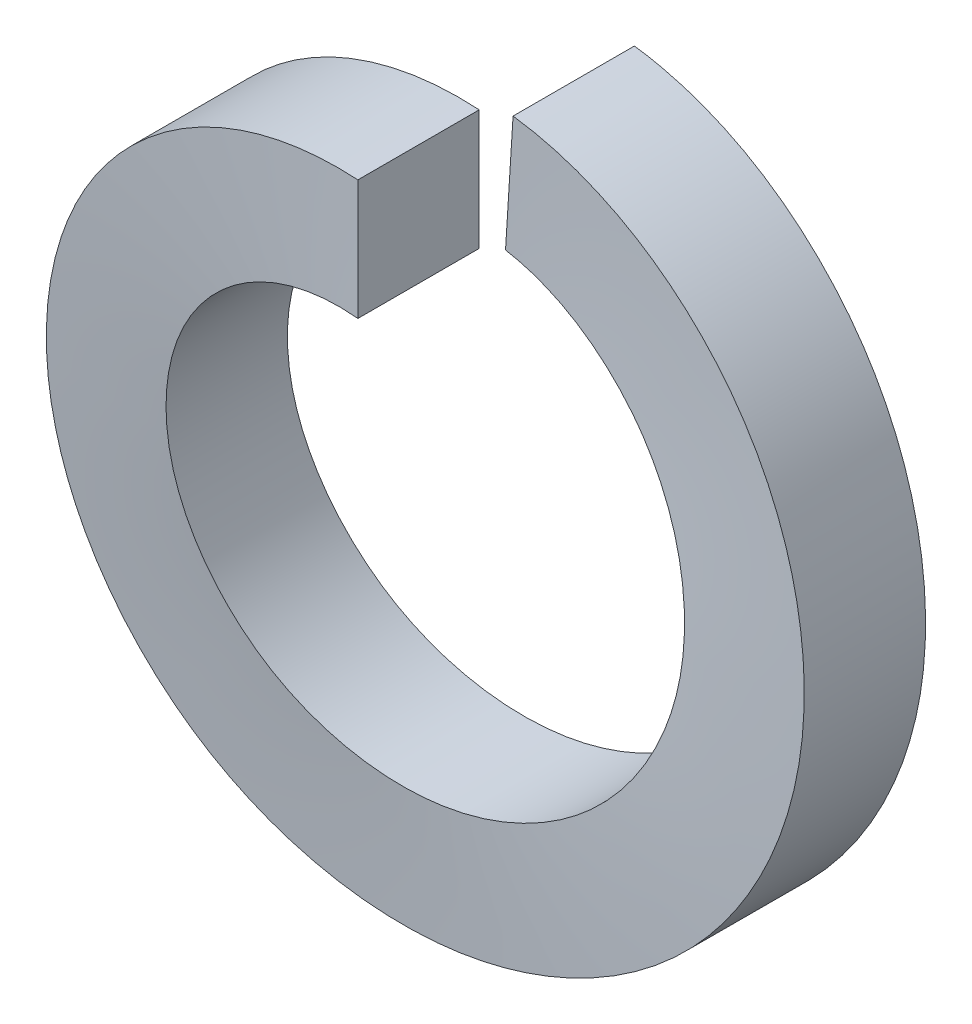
from build123d import *

# Parameters (mm, degrees)
SWEEP1_PITCH       = 1.326444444
SWEEP1_HEIGHT      = 1.31318
SWEEP1_RADIUS      = 3.3909
SWEEP1_START_ANGLE = 90
SKETCH2_W          = 1.1938
SKETCH2_H          = 1.1811


with BuildPart() as part:
    # Sweep1: sweep along a helix
    with BuildLine() as sweep1_path:
        add(Helix(SWEEP1_PITCH, SWEEP1_HEIGHT, SWEEP1_RADIUS, center=(0, 0, 0), direction=(0, 0, -1), lefthand=True, mode=Mode.PRIVATE).rotate(Axis((0, 0, 0), (0, 0, -1)), SWEEP1_START_ANGLE))
    # Sketch2 → Sweep1 (sweep)
    with BuildSketch(Plane(origin=(0, 0, 0), x_dir=(0, 0, -1), z_dir=(1, 0, 0))):
        with Locations((-0.5969, 2.80035)):
            Rectangle(SKETCH2_W, SKETCH2_H)
    sweep(path=sweep1_path.line, is_frenet=True)


solid = part.part
